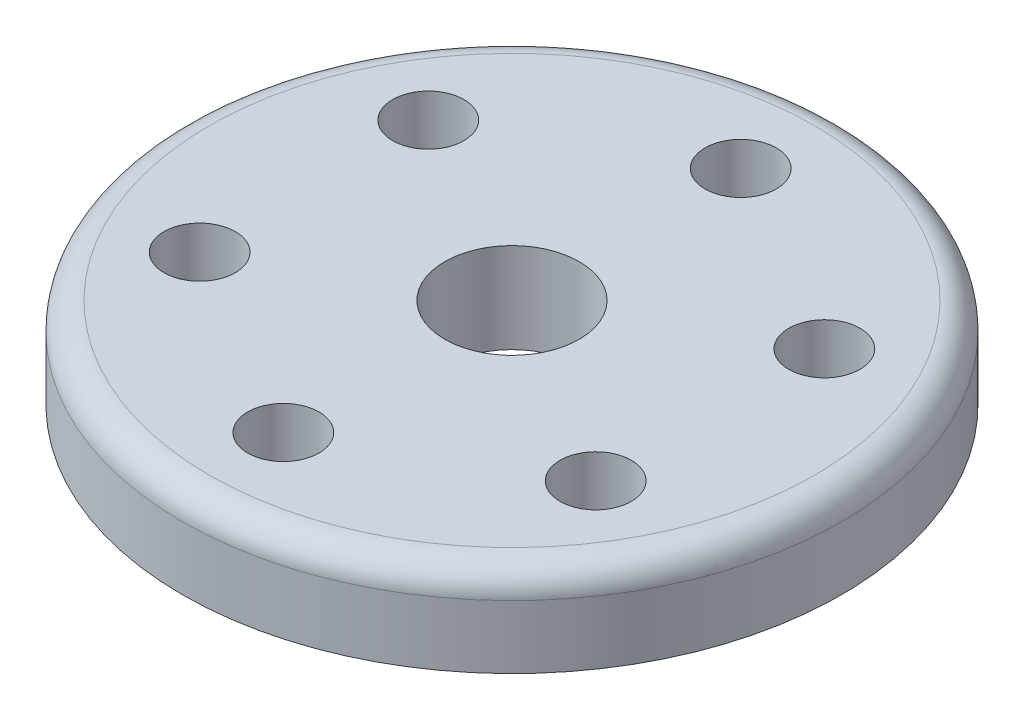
ISO-10303-21;
HEADER;
FILE_DESCRIPTION(('STEP AP214'),'2;1');
FILE_NAME('part.step','',(''),(''),'','','');
FILE_SCHEMA(('AUTOMOTIVE_DESIGN { 1 0 10303 214 1 1 1 1 }'));
ENDSEC;
DATA;
#1=APPLICATION_CONTEXT('core data for automotive mechanical design processes');
#2=APPLICATION_PROTOCOL_DEFINITION('international standard','automotive_design',2000,#1);
#3=PRODUCT_CONTEXT('',#1,'mechanical');
#4=PRODUCT('Part','Part','',(#3));
#5=PRODUCT_RELATED_PRODUCT_CATEGORY('part','',(#4));
#6=PRODUCT_DEFINITION_FORMATION('','',#4);
#7=PRODUCT_DEFINITION_CONTEXT('part definition',#1,'design');
#8=PRODUCT_DEFINITION('design','',#6,#7);
#9=PRODUCT_DEFINITION_SHAPE('','',#8);
#10=(LENGTH_UNIT() NAMED_UNIT(*) SI_UNIT(.MILLI.,.METRE.));
#11=(NAMED_UNIT(*) PLANE_ANGLE_UNIT() SI_UNIT($,.RADIAN.));
#12=(NAMED_UNIT(*) SI_UNIT($,.STERADIAN.) SOLID_ANGLE_UNIT());
#13=UNCERTAINTY_MEASURE_WITH_UNIT(LENGTH_MEASURE(1.E-05),#10,'distance_accuracy_value','');
#14=(GEOMETRIC_REPRESENTATION_CONTEXT(3) GLOBAL_UNCERTAINTY_ASSIGNED_CONTEXT((#13)) GLOBAL_UNIT_ASSIGNED_CONTEXT((#10,
#11,#12)) REPRESENTATION_CONTEXT('',''));
#15=CARTESIAN_POINT('',(0.,0.,0.));
#16=DIRECTION('',(0.,0.,1.));
#17=DIRECTION('',(1.,0.,0.));
#18=AXIS2_PLACEMENT_3D('',#15,#16,#17);
#19=CARTESIAN_POINT('',(0.,6.7,0.));
#20=DIRECTION('',(0.,1.,0.));
#21=DIRECTION('',(0.,0.,1.));
#22=AXIS2_PLACEMENT_3D('',#19,#20,#21);
#23=PLANE('',#22);
#24=CARTESIAN_POINT('',(0.,6.7,0.));
#25=DIRECTION('',(0.,1.,0.));
#26=DIRECTION('',(0.,0.,1.));
#27=AXIS2_PLACEMENT_3D('',#24,#25,#26);
#28=CIRCLE('',#27,22.5);
#29=CARTESIAN_POINT('',(0.,6.7,22.5));
#30=VERTEX_POINT('',#29);
#31=EDGE_CURVE('E38',#30,#30,#28,.T.);
#32=ORIENTED_EDGE('',*,*,#31,.T.);
#33=EDGE_LOOP('',(#32));
#34=FACE_BOUND('',#33,.T.);
#35=CARTESIAN_POINT('',(0.,6.7,-17.));
#36=DIRECTION('',(0.,1.,0.));
#37=DIRECTION('',(0.,0.,1.));
#38=AXIS2_PLACEMENT_3D('',#35,#36,#37);
#39=CIRCLE('',#38,2.64999999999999);
#40=CARTESIAN_POINT('',(0.,6.7,-14.35));
#41=VERTEX_POINT('',#40);
#42=EDGE_CURVE('E87',#41,#41,#39,.T.);
#43=ORIENTED_EDGE('',*,*,#42,.F.);
#44=EDGE_LOOP('',(#43));
#45=FACE_BOUND('',#44,.T.);
#46=CARTESIAN_POINT('',(14.7224318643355,6.7,-8.5));
#47=DIRECTION('',(0.,1.,0.));
#48=DIRECTION('',(0.,0.,1.));
#49=AXIS2_PLACEMENT_3D('',#46,#47,#48);
#50=CIRCLE('',#49,2.64999999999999);
#51=CARTESIAN_POINT('',(14.7224318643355,6.7,-5.85000000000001));
#52=VERTEX_POINT('',#51);
#53=EDGE_CURVE('E81',#52,#52,#50,.T.);
#54=ORIENTED_EDGE('',*,*,#53,.F.);
#55=EDGE_LOOP('',(#54));
#56=FACE_BOUND('',#55,.T.);
#57=CARTESIAN_POINT('',(14.7224318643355,6.7,8.5));
#58=DIRECTION('',(0.,1.,0.));
#59=DIRECTION('',(0.,0.,1.));
#60=AXIS2_PLACEMENT_3D('',#57,#58,#59);
#61=CIRCLE('',#60,2.64999999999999);
#62=CARTESIAN_POINT('',(14.7224318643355,6.7,11.15));
#63=VERTEX_POINT('',#62);
#64=EDGE_CURVE('E75',#63,#63,#61,.T.);
#65=ORIENTED_EDGE('',*,*,#64,.F.);
#66=EDGE_LOOP('',(#65));
#67=FACE_BOUND('',#66,.T.);
#68=CARTESIAN_POINT('',(0.,6.7,17.));
#69=DIRECTION('',(0.,1.,0.));
#70=DIRECTION('',(0.,0.,1.));
#71=AXIS2_PLACEMENT_3D('',#68,#69,#70);
#72=CIRCLE('',#71,2.64999999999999);
#73=CARTESIAN_POINT('',(0.,6.7,19.65));
#74=VERTEX_POINT('',#73);
#75=EDGE_CURVE('E69',#74,#74,#72,.T.);
#76=ORIENTED_EDGE('',*,*,#75,.F.);
#77=EDGE_LOOP('',(#76));
#78=FACE_BOUND('',#77,.T.);
#79=CARTESIAN_POINT('',(-14.7224318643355,6.7,8.5));
#80=DIRECTION('',(0.,1.,0.));
#81=DIRECTION('',(0.,0.,1.));
#82=AXIS2_PLACEMENT_3D('',#79,#80,#81);
#83=CIRCLE('',#82,2.64999999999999);
#84=CARTESIAN_POINT('',(-14.7224318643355,6.7,11.15));
#85=VERTEX_POINT('',#84);
#86=EDGE_CURVE('E63',#85,#85,#83,.T.);
#87=ORIENTED_EDGE('',*,*,#86,.F.);
#88=EDGE_LOOP('',(#87));
#89=FACE_BOUND('',#88,.T.);
#90=CARTESIAN_POINT('',(-14.7224318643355,6.7,-8.5));
#91=DIRECTION('',(0.,1.,0.));
#92=DIRECTION('',(0.,0.,1.));
#93=AXIS2_PLACEMENT_3D('',#90,#91,#92);
#94=CIRCLE('',#93,2.64999999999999);
#95=CARTESIAN_POINT('',(-14.7224318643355,6.7,-5.85000000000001));
#96=VERTEX_POINT('',#95);
#97=EDGE_CURVE('E57',#96,#96,#94,.T.);
#98=ORIENTED_EDGE('',*,*,#97,.F.);
#99=EDGE_LOOP('',(#98));
#100=FACE_BOUND('',#99,.T.);
#101=CARTESIAN_POINT('',(0.,6.7,0.));
#102=DIRECTION('',(0.,1.,0.));
#103=DIRECTION('',(0.,0.,1.));
#104=AXIS2_PLACEMENT_3D('',#101,#102,#103);
#105=CIRCLE('',#104,5.);
#106=CARTESIAN_POINT('',(0.,6.7,5.));
#107=VERTEX_POINT('',#106);
#108=EDGE_CURVE('E46',#107,#107,#105,.T.);
#109=ORIENTED_EDGE('',*,*,#108,.F.);
#110=EDGE_LOOP('',(#109));
#111=FACE_BOUND('',#110,.T.);
#112=ADVANCED_FACE('F31',(#34,#45,#56,#67,#78,#89,#100,#111),#23,.T.);
#113=CARTESIAN_POINT('',(0.,0.,0.));
#114=DIRECTION('',(0.,1.,0.));
#115=DIRECTION('',(0.,0.,1.));
#116=AXIS2_PLACEMENT_3D('',#113,#114,#115);
#117=PLANE('',#116);
#118=CARTESIAN_POINT('',(0.,0.,-17.));
#119=DIRECTION('',(0.,1.,0.));
#120=DIRECTION('',(0.,0.,1.));
#121=AXIS2_PLACEMENT_3D('',#118,#119,#120);
#122=CIRCLE('',#121,2.65);
#123=CARTESIAN_POINT('',(0.,0.,-14.35));
#124=VERTEX_POINT('',#123);
#125=EDGE_CURVE('E84',#124,#124,#122,.T.);
#126=ORIENTED_EDGE('',*,*,#125,.T.);
#127=EDGE_LOOP('',(#126));
#128=FACE_BOUND('',#127,.T.);
#129=CARTESIAN_POINT('',(14.7224318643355,0.,-8.5));
#130=DIRECTION('',(0.,1.,0.));
#131=DIRECTION('',(0.,0.,1.));
#132=AXIS2_PLACEMENT_3D('',#129,#130,#131);
#133=CIRCLE('',#132,2.65);
#134=CARTESIAN_POINT('',(14.7224318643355,0.,-5.85));
#135=VERTEX_POINT('',#134);
#136=EDGE_CURVE('E78',#135,#135,#133,.T.);
#137=ORIENTED_EDGE('',*,*,#136,.T.);
#138=EDGE_LOOP('',(#137));
#139=FACE_BOUND('',#138,.T.);
#140=CARTESIAN_POINT('',(14.7224318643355,0.,8.5));
#141=DIRECTION('',(0.,1.,0.));
#142=DIRECTION('',(0.,0.,1.));
#143=AXIS2_PLACEMENT_3D('',#140,#141,#142);
#144=CIRCLE('',#143,2.65);
#145=CARTESIAN_POINT('',(14.7224318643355,0.,11.15));
#146=VERTEX_POINT('',#145);
#147=EDGE_CURVE('E72',#146,#146,#144,.T.);
#148=ORIENTED_EDGE('',*,*,#147,.T.);
#149=EDGE_LOOP('',(#148));
#150=FACE_BOUND('',#149,.T.);
#151=CARTESIAN_POINT('',(0.,0.,17.));
#152=DIRECTION('',(0.,1.,0.));
#153=DIRECTION('',(0.,0.,1.));
#154=AXIS2_PLACEMENT_3D('',#151,#152,#153);
#155=CIRCLE('',#154,2.65);
#156=CARTESIAN_POINT('',(0.,0.,19.65));
#157=VERTEX_POINT('',#156);
#158=EDGE_CURVE('E66',#157,#157,#155,.T.);
#159=ORIENTED_EDGE('',*,*,#158,.T.);
#160=EDGE_LOOP('',(#159));
#161=FACE_BOUND('',#160,.T.);
#162=CARTESIAN_POINT('',(-14.7224318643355,0.,8.5));
#163=DIRECTION('',(0.,1.,0.));
#164=DIRECTION('',(0.,0.,1.));
#165=AXIS2_PLACEMENT_3D('',#162,#163,#164);
#166=CIRCLE('',#165,2.65);
#167=CARTESIAN_POINT('',(-14.7224318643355,0.,11.15));
#168=VERTEX_POINT('',#167);
#169=EDGE_CURVE('E60',#168,#168,#166,.T.);
#170=ORIENTED_EDGE('',*,*,#169,.T.);
#171=EDGE_LOOP('',(#170));
#172=FACE_BOUND('',#171,.T.);
#173=CARTESIAN_POINT('',(-14.7224318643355,0.,-8.5));
#174=DIRECTION('',(0.,1.,0.));
#175=DIRECTION('',(0.,0.,1.));
#176=AXIS2_PLACEMENT_3D('',#173,#174,#175);
#177=CIRCLE('',#176,2.65);
#178=CARTESIAN_POINT('',(-14.7224318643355,0.,-5.85));
#179=VERTEX_POINT('',#178);
#180=EDGE_CURVE('E52',#179,#179,#177,.T.);
#181=ORIENTED_EDGE('',*,*,#180,.T.);
#182=EDGE_LOOP('',(#181));
#183=FACE_BOUND('',#182,.T.);
#184=CARTESIAN_POINT('',(0.,0.,0.));
#185=DIRECTION('',(0.,1.,0.));
#186=DIRECTION('',(0.,0.,1.));
#187=AXIS2_PLACEMENT_3D('',#184,#185,#186);
#188=CIRCLE('',#187,24.5);
#189=CARTESIAN_POINT('',(0.,0.,24.5));
#190=VERTEX_POINT('',#189);
#191=EDGE_CURVE('E42',#190,#190,#188,.T.);
#192=ORIENTED_EDGE('',*,*,#191,.F.);
#193=EDGE_LOOP('',(#192));
#194=FACE_BOUND('',#193,.T.);
#195=CARTESIAN_POINT('',(0.,0.,0.));
#196=DIRECTION('',(0.,1.,0.));
#197=DIRECTION('',(0.,0.,1.));
#198=AXIS2_PLACEMENT_3D('',#195,#196,#197);
#199=CIRCLE('',#198,5.);
#200=CARTESIAN_POINT('',(0.,0.,5.));
#201=VERTEX_POINT('',#200);
#202=EDGE_CURVE('E49',#201,#201,#199,.T.);
#203=ORIENTED_EDGE('',*,*,#202,.T.);
#204=EDGE_LOOP('',(#203));
#205=FACE_BOUND('',#204,.T.);
#206=ADVANCED_FACE('F95',(#128,#139,#150,#161,#172,#183,#194,#205),#117,.F.);
#207=CARTESIAN_POINT('',(0.,6.7,0.));
#208=DIRECTION('',(0.,-1.,0.));
#209=DIRECTION('',(0.,0.,-1.));
#210=AXIS2_PLACEMENT_3D('',#207,#208,#209);
#211=CYLINDRICAL_SURFACE('',#210,24.5);
#212=CARTESIAN_POINT('',(0.,4.7,0.));
#213=DIRECTION('',(0.,1.,0.));
#214=DIRECTION('',(0.,0.,1.));
#215=AXIS2_PLACEMENT_3D('',#212,#213,#214);
#216=CIRCLE('',#215,24.5);
#217=CARTESIAN_POINT('',(0.,4.7,24.5));
#218=VERTEX_POINT('',#217);
#219=EDGE_CURVE('E10',#218,#218,#216,.F.);
#220=ORIENTED_EDGE('',*,*,#219,.T.);
#221=EDGE_LOOP('',(#220));
#222=FACE_BOUND('',#221,.T.);
#223=ORIENTED_EDGE('',*,*,#191,.T.);
#224=EDGE_LOOP('',(#223));
#225=FACE_BOUND('',#224,.T.);
#226=ADVANCED_FACE('F113',(#222,#225),#211,.T.);
#227=CARTESIAN_POINT('',(0.,6.7,0.));
#228=DIRECTION('',(0.,-1.,0.));
#229=DIRECTION('',(0.,0.,-1.));
#230=AXIS2_PLACEMENT_3D('',#227,#228,#229);
#231=CYLINDRICAL_SURFACE('',#230,5.);
#232=ORIENTED_EDGE('',*,*,#108,.T.);
#233=EDGE_LOOP('',(#232));
#234=FACE_BOUND('',#233,.T.);
#235=ORIENTED_EDGE('',*,*,#202,.F.);
#236=EDGE_LOOP('',(#235));
#237=FACE_BOUND('',#236,.T.);
#238=ADVANCED_FACE('F109',(#234,#237),#231,.F.);
#239=CARTESIAN_POINT('',(-14.7224318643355,6.7,-8.5));
#240=DIRECTION('',(0.,1.,0.));
#241=DIRECTION('',(0.,0.,1.));
#242=AXIS2_PLACEMENT_3D('',#239,#240,#241);
#243=CYLINDRICAL_SURFACE('',#242,2.64999999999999);
#244=ORIENTED_EDGE('',*,*,#180,.F.);
#245=EDGE_LOOP('',(#244));
#246=FACE_BOUND('',#245,.T.);
#247=ORIENTED_EDGE('',*,*,#97,.T.);
#248=EDGE_LOOP('',(#247));
#249=FACE_BOUND('',#248,.T.);
#250=ADVANCED_FACE('F112',(#246,#249),#243,.F.);
#251=CARTESIAN_POINT('',(-14.7224318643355,6.7,8.5));
#252=DIRECTION('',(0.,1.,0.));
#253=DIRECTION('',(0.,0.,1.));
#254=AXIS2_PLACEMENT_3D('',#251,#252,#253);
#255=CYLINDRICAL_SURFACE('',#254,2.64999999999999);
#256=ORIENTED_EDGE('',*,*,#169,.F.);
#257=EDGE_LOOP('',(#256));
#258=FACE_BOUND('',#257,.T.);
#259=ORIENTED_EDGE('',*,*,#86,.T.);
#260=EDGE_LOOP('',(#259));
#261=FACE_BOUND('',#260,.T.);
#262=ADVANCED_FACE('F127',(#258,#261),#255,.F.);
#263=CARTESIAN_POINT('',(0.,6.7,17.));
#264=DIRECTION('',(0.,1.,0.));
#265=DIRECTION('',(0.,0.,1.));
#266=AXIS2_PLACEMENT_3D('',#263,#264,#265);
#267=CYLINDRICAL_SURFACE('',#266,2.64999999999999);
#268=ORIENTED_EDGE('',*,*,#158,.F.);
#269=EDGE_LOOP('',(#268));
#270=FACE_BOUND('',#269,.T.);
#271=ORIENTED_EDGE('',*,*,#75,.T.);
#272=EDGE_LOOP('',(#271));
#273=FACE_BOUND('',#272,.T.);
#274=ADVANCED_FACE('F131',(#270,#273),#267,.F.);
#275=CARTESIAN_POINT('',(14.7224318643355,6.7,8.5));
#276=DIRECTION('',(0.,1.,0.));
#277=DIRECTION('',(0.,0.,1.));
#278=AXIS2_PLACEMENT_3D('',#275,#276,#277);
#279=CYLINDRICAL_SURFACE('',#278,2.64999999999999);
#280=ORIENTED_EDGE('',*,*,#147,.F.);
#281=EDGE_LOOP('',(#280));
#282=FACE_BOUND('',#281,.T.);
#283=ORIENTED_EDGE('',*,*,#64,.T.);
#284=EDGE_LOOP('',(#283));
#285=FACE_BOUND('',#284,.T.);
#286=ADVANCED_FACE('F135',(#282,#285),#279,.F.);
#287=CARTESIAN_POINT('',(14.7224318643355,6.7,-8.5));
#288=DIRECTION('',(0.,1.,0.));
#289=DIRECTION('',(0.,0.,1.));
#290=AXIS2_PLACEMENT_3D('',#287,#288,#289);
#291=CYLINDRICAL_SURFACE('',#290,2.64999999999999);
#292=ORIENTED_EDGE('',*,*,#136,.F.);
#293=EDGE_LOOP('',(#292));
#294=FACE_BOUND('',#293,.T.);
#295=ORIENTED_EDGE('',*,*,#53,.T.);
#296=EDGE_LOOP('',(#295));
#297=FACE_BOUND('',#296,.T.);
#298=ADVANCED_FACE('F139',(#294,#297),#291,.F.);
#299=CARTESIAN_POINT('',(0.,6.7,-17.));
#300=DIRECTION('',(0.,1.,0.));
#301=DIRECTION('',(0.,0.,1.));
#302=AXIS2_PLACEMENT_3D('',#299,#300,#301);
#303=CYLINDRICAL_SURFACE('',#302,2.64999999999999);
#304=ORIENTED_EDGE('',*,*,#125,.F.);
#305=EDGE_LOOP('',(#304));
#306=FACE_BOUND('',#305,.T.);
#307=ORIENTED_EDGE('',*,*,#42,.T.);
#308=EDGE_LOOP('',(#307));
#309=FACE_BOUND('',#308,.T.);
#310=ADVANCED_FACE('F91',(#306,#309),#303,.F.);
#311=CARTESIAN_POINT('',(0.,4.7,0.));
#312=DIRECTION('',(0.,1.,0.));
#313=DIRECTION('',(0.,0.,1.));
#314=AXIS2_PLACEMENT_3D('',#311,#312,#313);
#315=TOROIDAL_SURFACE('',#314,22.5,2.);
#316=ORIENTED_EDGE('',*,*,#219,.F.);
#317=EDGE_LOOP('',(#316));
#318=FACE_BOUND('',#317,.T.);
#319=ORIENTED_EDGE('',*,*,#31,.F.);
#320=EDGE_LOOP('',(#319));
#321=FACE_BOUND('',#320,.T.);
#322=ADVANCED_FACE('F33',(#318,#321),#315,.T.);
#323=CLOSED_SHELL('',(#112,#206,#226,#238,#250,#262,#274,#286,#298,#310,#322));
#324=MANIFOLD_SOLID_BREP('B2',#323);
#325=ADVANCED_BREP_SHAPE_REPRESENTATION('',(#18,#324),#14);
#326=SHAPE_DEFINITION_REPRESENTATION(#9,#325);
ENDSEC;
END-ISO-10303-21;
